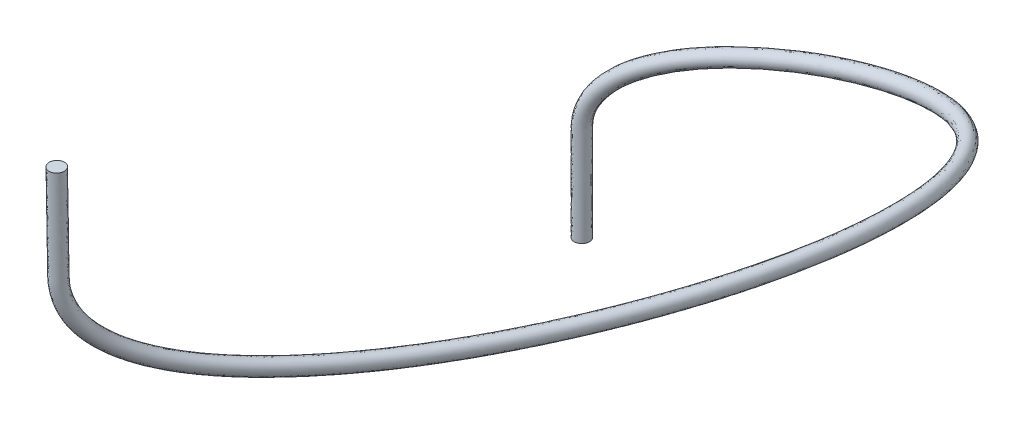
ISO-10303-21;
HEADER;
FILE_DESCRIPTION(('STEP AP214'),'2;1');
FILE_NAME('part.step','',(''),(''),'','','');
FILE_SCHEMA(('AUTOMOTIVE_DESIGN { 1 0 10303 214 1 1 1 1 }'));
ENDSEC;
DATA;
#1=APPLICATION_CONTEXT('core data for automotive mechanical design processes');
#2=APPLICATION_PROTOCOL_DEFINITION('international standard','automotive_design',2000,#1);
#3=PRODUCT_CONTEXT('',#1,'mechanical');
#4=PRODUCT('Part','Part','',(#3));
#5=PRODUCT_RELATED_PRODUCT_CATEGORY('part','',(#4));
#6=PRODUCT_DEFINITION_FORMATION('','',#4);
#7=PRODUCT_DEFINITION_CONTEXT('part definition',#1,'design');
#8=PRODUCT_DEFINITION('design','',#6,#7);
#9=PRODUCT_DEFINITION_SHAPE('','',#8);
#10=(LENGTH_UNIT() NAMED_UNIT(*) SI_UNIT(.MILLI.,.METRE.));
#11=(NAMED_UNIT(*) PLANE_ANGLE_UNIT() SI_UNIT($,.RADIAN.));
#12=(NAMED_UNIT(*) SI_UNIT($,.STERADIAN.) SOLID_ANGLE_UNIT());
#13=UNCERTAINTY_MEASURE_WITH_UNIT(LENGTH_MEASURE(1.E-05),#10,'distance_accuracy_value','');
#14=(GEOMETRIC_REPRESENTATION_CONTEXT(3) GLOBAL_UNCERTAINTY_ASSIGNED_CONTEXT((#13)) GLOBAL_UNIT_ASSIGNED_CONTEXT((#10,
#11,#12)) REPRESENTATION_CONTEXT('',''));
#15=CARTESIAN_POINT('',(0.,0.,0.));
#16=DIRECTION('',(0.,0.,1.));
#17=DIRECTION('',(1.,0.,0.));
#18=AXIS2_PLACEMENT_3D('',#15,#16,#17);
#19=CARTESIAN_POINT('',(50.7999999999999,71.5645,13.3985));
#20=DIRECTION('',(0.,1.,0.));
#21=DIRECTION('',(-1.,0.,0.));
#22=AXIS2_PLACEMENT_3D('',#19,#20,#21);
#23=PLANE('',#22);
#24=CARTESIAN_POINT('',(51.613000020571,71.5645,13.3985));
#25=CARTESIAN_POINT('',(51.613000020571,71.5645,12.9728141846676));
#26=CARTESIAN_POINT('',(51.2256858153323,71.5645,12.585499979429));
#27=CARTESIAN_POINT('',(50.3743141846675,71.5645,12.585499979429));
#28=CARTESIAN_POINT('',(49.9869999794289,71.5645,12.9728141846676));
#29=CARTESIAN_POINT('',(49.9869999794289,71.5645,13.8241858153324));
#30=CARTESIAN_POINT('',(50.3743141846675,71.5645,14.2115000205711));
#31=CARTESIAN_POINT('',(51.2256858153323,71.5645,14.2115000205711));
#32=CARTESIAN_POINT('',(51.613000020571,71.5645,13.8241858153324));
#33=CARTESIAN_POINT('',(51.613000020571,71.5645,13.3985));
#34=B_SPLINE_CURVE_WITH_KNOTS('',3,(#24,#25,#26,#27,#28,#29,#30,#31,#32,#33),.UNSPECIFIED.,.T.,
.F.,(4,2,2,2,4),(0.,0.25,0.5,0.75,1.),.UNSPECIFIED.);
#35=CARTESIAN_POINT('',(51.613000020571,71.5645,13.3985));
#36=VERTEX_POINT('',#35);
#37=EDGE_CURVE('E25',#36,#36,#34,.T.);
#38=ORIENTED_EDGE('',*,*,#37,.F.);
#39=EDGE_LOOP('',(#38));
#40=FACE_BOUND('',#39,.T.);
#41=ADVANCED_FACE('F15',(#40),#23,.F.);
#42=CARTESIAN_POINT('',(69.1868432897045,124.059388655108,87.1141724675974));
#43=DIRECTION('',(0.,0.999847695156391,0.0174524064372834));
#44=DIRECTION('',(0.997030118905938,-0.00134405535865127,0.0770008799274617));
#45=AXIS2_PLACEMENT_3D('',#42,#43,#44);
#46=PLANE('',#45);
#47=CARTESIAN_POINT('',(68.376257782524,124.060481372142,87.0515707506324));
#48=CARTESIAN_POINT('',(68.4090409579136,124.067888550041,86.6272138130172));
#49=CARTESIAN_POINT('',(68.8250329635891,124.074107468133,86.2709322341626));
#50=CARTESIAN_POINT('',(69.673876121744,124.07296317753,86.3364885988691));
#51=CARTESIAN_POINT('',(70.0302119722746,124.065703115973,86.7524172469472));
#52=CARTESIAN_POINT('',(69.9646456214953,124.050888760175,87.6011311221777));
#53=CARTESIAN_POINT('',(69.5486536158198,124.044669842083,87.9574127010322));
#54=CARTESIAN_POINT('',(68.6998104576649,124.045814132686,87.8918563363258));
#55=CARTESIAN_POINT('',(68.3434746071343,124.053074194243,87.4759276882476));
#56=CARTESIAN_POINT('',(68.376257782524,124.060481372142,87.0515707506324));
#57=B_SPLINE_CURVE_WITH_KNOTS('',3,(#47,#48,#49,#50,#51,#52,#53,#54,#55,#56),.UNSPECIFIED.,.T.,
.F.,(4,2,2,2,4),(0.,0.25,0.5,0.75,1.),.UNSPECIFIED.);
#58=CARTESIAN_POINT('',(68.376257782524,124.060481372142,87.0515707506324));
#59=VERTEX_POINT('',#58);
#60=EDGE_CURVE('E10',#59,#59,#57,.F.);
#61=ORIENTED_EDGE('',*,*,#60,.T.);
#62=EDGE_LOOP('',(#61));
#63=FACE_BOUND('',#62,.T.);
#64=ADVANCED_FACE('F33',(#63),#46,.T.);
#65=CARTESIAN_POINT('',(51.613000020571,71.5645,13.3985));
#66=CARTESIAN_POINT('',(51.6130000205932,74.7632466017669,13.3985000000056));
#67=CARTESIAN_POINT('',(51.6131398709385,78.9634218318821,13.4099341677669));
#68=CARTESIAN_POINT('',(51.6118456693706,82.9005774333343,13.4442220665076));
#69=CARTESIAN_POINT('',(52.029580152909,83.9173640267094,13.3042981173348));
#70=CARTESIAN_POINT('',(53.5431929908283,86.0515290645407,12.8288250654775));
#71=CARTESIAN_POINT('',(54.6488081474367,87.0616244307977,12.4902943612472));
#72=CARTESIAN_POINT('',(58.7017758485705,89.8802265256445,11.3593784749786));
#73=CARTESIAN_POINT('',(62.3208688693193,91.4703244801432,10.4698475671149));
#74=CARTESIAN_POINT('',(73.4478905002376,95.0920083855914,8.12497083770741));
#75=CARTESIAN_POINT('',(81.2426269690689,96.4136495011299,7.47482045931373));
#76=CARTESIAN_POINT('',(90.8979193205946,98.03423919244,11.5997255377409));
#77=CARTESIAN_POINT('',(92.4731165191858,98.2078756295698,16.8489973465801));
#78=CARTESIAN_POINT('',(91.8996524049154,98.4220433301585,30.543460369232));
#79=CARTESIAN_POINT('',(89.6071188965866,98.4605445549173,38.9733592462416));
#80=CARTESIAN_POINT('',(83.4004500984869,99.1605925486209,56.3878073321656));
#81=CARTESIAN_POINT('',(79.3563143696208,99.8175887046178,65.5343596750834));
#82=CARTESIAN_POINT('',(73.7289225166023,103.007696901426,76.7847322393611));
#83=CARTESIAN_POINT('',(71.9809860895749,104.379361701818,80.1394346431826));
#84=CARTESIAN_POINT('',(69.9734392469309,107.265662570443,83.9129531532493));
#85=CARTESIAN_POINT('',(69.4118644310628,108.36450238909,84.952636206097));
#86=CARTESIAN_POINT('',(68.6122048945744,110.921915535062,86.4320876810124));
#87=CARTESIAN_POINT('',(68.3748236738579,112.423328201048,86.8711083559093));
#88=CARTESIAN_POINT('',(68.3757362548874,116.904421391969,86.9322090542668));
#89=CARTESIAN_POINT('',(68.3762577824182,120.67969669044,86.9925589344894));
#90=CARTESIAN_POINT('',(68.376257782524,124.060481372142,87.0515707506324));
#91=CARTESIAN_POINT('',(51.613000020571,71.5645,12.9728141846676));
#92=CARTESIAN_POINT('',(51.613000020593,74.7335254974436,12.9728141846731));
#93=CARTESIAN_POINT('',(51.6191110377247,79.002994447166,12.9841219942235));
#94=CARTESIAN_POINT('',(51.6357937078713,82.8804249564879,13.0191677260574));
#95=CARTESIAN_POINT('',(52.0445546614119,83.8385707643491,12.8852770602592));
#96=CARTESIAN_POINT('',(53.5447920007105,85.919322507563,12.4232019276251));
#97=CARTESIAN_POINT('',(54.6466438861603,86.9099619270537,12.0917839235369));
#98=CARTESIAN_POINT('',(58.7062225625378,89.6613098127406,10.9910070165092));
#99=CARTESIAN_POINT('',(62.3449404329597,91.1952276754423,10.1458761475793));
#100=CARTESIAN_POINT('',(73.4646093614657,94.8147091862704,7.80238583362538));
#101=CARTESIAN_POINT('',(81.2777949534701,96.1470286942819,7.11305510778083));
#102=CARTESIAN_POINT('',(91.2177502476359,97.8045955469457,11.3674644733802));
#103=CARTESIAN_POINT('',(92.8330984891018,97.9750719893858,16.8041569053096));
#104=CARTESIAN_POINT('',(92.216780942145,98.1395563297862,30.6171204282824));
#105=CARTESIAN_POINT('',(89.8649675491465,98.1303414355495,39.0526254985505));
#106=CARTESIAN_POINT('',(83.6419586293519,98.8322550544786,56.5129923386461));
#107=CARTESIAN_POINT('',(79.6259502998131,99.5137718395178,65.6883199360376));
#108=CARTESIAN_POINT('',(73.8838887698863,102.661432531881,76.98264826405));
#109=CARTESIAN_POINT('',(72.1027729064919,104.030522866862,80.3641549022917));
#110=CARTESIAN_POINT('',(70.03351966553,106.971370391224,84.2169987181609));
#111=CARTESIAN_POINT('',(69.4486675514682,108.100584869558,85.2908266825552));
#112=CARTESIAN_POINT('',(68.6073253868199,110.763332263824,86.8323466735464));
#113=CARTESIAN_POINT('',(68.3539298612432,112.379312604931,87.2955883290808));
#114=CARTESIAN_POINT('',(68.3458157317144,116.9609708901,87.3579362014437));
#115=CARTESIAN_POINT('',(68.3434746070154,120.624251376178,87.4160773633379));
#116=CARTESIAN_POINT('',(68.3434746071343,124.053074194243,87.4759276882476));
#117=CARTESIAN_POINT('',(51.2256858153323,71.5645,12.585499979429));
#118=CARTESIAN_POINT('',(51.2256858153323,74.7718197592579,12.5854999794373));
#119=CARTESIAN_POINT('',(51.2371087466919,78.9520069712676,12.5912654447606));
#120=CARTESIAN_POINT('',(51.270846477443,82.9063904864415,12.6106359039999));
#121=CARTESIAN_POINT('',(51.7066231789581,83.9349418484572,12.4635284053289));
#122=CARTESIAN_POINT('',(53.261258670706,86.0553834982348,11.9732538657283));
#123=CARTESIAN_POINT('',(54.3897287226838,87.0471157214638,11.6267935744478));
#124=CARTESIAN_POINT('',(58.5237456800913,89.760597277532,10.4802225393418));
#125=CARTESIAN_POINT('',(62.2058710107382,91.2081847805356,9.61579812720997));
#126=CARTESIAN_POINT('',(73.385853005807,94.8476143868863,7.25961100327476));
#127=CARTESIAN_POINT('',(81.2459062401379,96.1983433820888,6.51250528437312));
#128=CARTESIAN_POINT('',(91.6788481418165,97.9205543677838,10.9735894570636));
#129=CARTESIAN_POINT('',(93.3735545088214,98.0886646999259,16.719601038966));
#130=CARTESIAN_POINT('',(92.7612027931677,98.1737037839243,30.7378867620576));
#131=CARTESIAN_POINT('',(90.3882489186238,98.0745746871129,39.2078288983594));
#132=CARTESIAN_POINT('',(84.1440600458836,98.7789180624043,56.727633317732));
#133=CARTESIAN_POINT('',(80.1356244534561,99.5168774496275,65.9092822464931));
#134=CARTESIAN_POINT('',(74.3471954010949,102.543682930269,77.2540352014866));
#135=CARTESIAN_POINT('',(72.547548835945,103.892770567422,80.6552004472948));
#136=CARTESIAN_POINT('',(70.4452606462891,106.841796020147,84.5547493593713));
#137=CARTESIAN_POINT('',(69.8480352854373,107.981298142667,85.6474872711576));
#138=CARTESIAN_POINT('',(68.9842044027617,110.687779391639,87.2237347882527));
#139=CARTESIAN_POINT('',(68.7217778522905,112.355410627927,87.7011023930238));
#140=CARTESIAN_POINT('',(68.704984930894,116.983147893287,87.7720013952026));
#141=CARTESIAN_POINT('',(68.699810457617,120.594913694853,87.831620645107));
#142=CARTESIAN_POINT('',(68.6998104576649,124.045814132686,87.8918563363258));
#143=CARTESIAN_POINT('',(50.3743141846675,71.5645,12.585499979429));
#144=CARTESIAN_POINT('',(50.3743141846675,74.915438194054,12.5854999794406));
#145=CARTESIAN_POINT('',(50.3854711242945,78.7607840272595,12.57933530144));
#146=CARTESIAN_POINT('',(50.4207445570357,83.0037713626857,12.562733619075));
#147=CARTESIAN_POINT('',(50.9338527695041,84.304365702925,12.3745070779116));
#148=CARTESIAN_POINT('',(52.6348141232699,86.6188779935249,11.7954503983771));
#149=CARTESIAN_POINT('',(53.8293212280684,87.6519242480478,11.4016996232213));
#150=CARTESIAN_POINT('',(58.1137421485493,90.4166786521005,10.09418863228));
#151=CARTESIAN_POINT('',(61.8520335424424,91.7868599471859,9.09855419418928));
#152=CARTESIAN_POINT('',(73.1792976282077,95.4745430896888,6.71168484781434));
#153=CARTESIAN_POINT('',(81.1054743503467,96.8443819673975,5.91594218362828));
#154=CARTESIAN_POINT('',(92.052744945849,98.6347356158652,10.5723183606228));
#155=CARTESIAN_POINT('',(93.8415896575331,98.8039648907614,16.6234161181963));
#156=CARTESIAN_POINT('',(93.323662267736,98.8137387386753,30.8560281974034));
#157=CARTESIAN_POINT('',(91.0227983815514,98.6123976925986,39.3904555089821));
#158=CARTESIAN_POINT('',(84.7647332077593,99.3183507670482,56.9490746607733));
#159=CARTESIAN_POINT('',(80.7166887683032,100.131337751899,66.087068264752));
#160=CARTESIAN_POINT('',(75.0556766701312,102.977381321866,77.4547501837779));
#161=CARTESIAN_POINT('',(73.2816558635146,104.287649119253,80.8455193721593));
#162=CARTESIAN_POINT('',(71.2301649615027,107.145557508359,84.6890821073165));
#163=CARTESIAN_POINT('',(70.6522960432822,108.246924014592,85.7550969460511));
#164=CARTESIAN_POINT('',(69.8223970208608,110.838869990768,87.2835434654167));
#165=CARTESIAN_POINT('',(69.5721476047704,112.390901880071,87.7435199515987));
#166=CARTESIAN_POINT('',(69.5543308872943,116.918797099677,87.8307212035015));
#167=CARTESIAN_POINT('',(69.5486536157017,120.641315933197,87.898006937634));
#168=CARTESIAN_POINT('',(69.5486536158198,124.044669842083,87.9574127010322));
#169=CARTESIAN_POINT('',(49.9869999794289,71.5645,12.9728141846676));
#170=CARTESIAN_POINT('',(49.9869999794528,75.0078165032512,12.9728141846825));
#171=CARTESIAN_POINT('',(49.9926029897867,78.6377855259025,12.9613370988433));
#172=CARTESIAN_POINT('',(50.0122186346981,83.0664087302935,12.9276811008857));
#173=CARTESIAN_POINT('',(50.5686718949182,84.5441183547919,12.7152588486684));
#174=CARTESIAN_POINT('',(52.348371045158,86.9955177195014,12.0836223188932));
#175=CARTESIAN_POINT('',(53.5763444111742,88.065061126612,11.6618861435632));
#176=CARTESIAN_POINT('',(57.9231734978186,90.9143329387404,10.2537365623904));
#177=CARTESIAN_POINT('',(61.6691606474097,92.3004158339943,9.15801300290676));
#178=CARTESIAN_POINT('',(73.0701176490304,96.0120548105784,6.75592396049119));
#179=CARTESIAN_POINT('',(81.0095898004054,97.3808715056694,5.97370351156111));
#180=CARTESIAN_POINT('',(91.9318405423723,99.1685812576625,10.6010931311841));
#181=CARTESIAN_POINT('',(93.726979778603,99.3411947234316,16.6204572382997));
#182=CARTESIAN_POINT('',(93.2909994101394,99.3619330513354,30.8427539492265));
#183=CARTESIAN_POINT('',(91.0768677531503,99.1575077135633,39.4014166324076));
#184=CARTESIAN_POINT('',(84.8273570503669,99.8624956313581,56.9359141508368));
#185=CARTESIAN_POINT('',(80.7357013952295,100.687304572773,66.0278662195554));
#186=CARTESIAN_POINT('',(75.2369883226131,103.489735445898,77.3659856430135));
#187=CARTESIAN_POINT('',(73.5048140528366,104.784685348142,80.7276372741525));
#188=CARTESIAN_POINT('',(71.5325764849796,107.551512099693,84.4735553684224));
#189=CARTESIAN_POINT('',(70.9846924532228,108.607892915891,85.4963460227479));
#190=CARTESIAN_POINT('',(70.208155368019,111.051894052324,86.9465728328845));
#191=CARTESIAN_POINT('',(69.9780164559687,112.447095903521,87.3765998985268));
#192=CARTESIAN_POINT('',(69.967947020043,116.838069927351,87.4700827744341));
#193=CARTESIAN_POINT('',(69.964645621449,120.712873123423,87.5428658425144));
#194=CARTESIAN_POINT('',(69.9646456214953,124.050888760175,87.6011311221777));
#195=CARTESIAN_POINT('',(49.9869999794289,71.5645,13.8241858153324));
#196=CARTESIAN_POINT('',(49.9869999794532,75.0672587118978,13.8241858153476));
#197=CARTESIAN_POINT('',(49.9806606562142,78.5586402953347,13.8129614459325));
#198=CARTESIAN_POINT('',(49.9643225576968,83.1067136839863,13.7777897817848));
#199=CARTESIAN_POINT('',(50.5387228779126,84.7017048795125,13.5533009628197));
#200=CARTESIAN_POINT('',(52.3451730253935,87.2599308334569,12.8948685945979));
#201=CARTESIAN_POINT('',(53.5806729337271,88.3683861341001,12.4589070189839));
#202=CARTESIAN_POINT('',(57.9142800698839,91.3521663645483,10.9904794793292));
#203=CARTESIAN_POINT('',(61.621017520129,92.8506094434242,9.80595584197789));
#204=CARTESIAN_POINT('',(73.0366799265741,96.5666532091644,7.40109396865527));
#205=CARTESIAN_POINT('',(80.9392538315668,97.9141131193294,6.6972342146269));
#206=CARTESIAN_POINT('',(91.2921786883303,99.6278685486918,11.0656152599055));
#207=CARTESIAN_POINT('',(93.0070158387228,99.8068020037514,16.7101381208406));
#208=CARTESIAN_POINT('',(92.6567423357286,99.9269070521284,30.6954338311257));
#209=CARTESIAN_POINT('',(90.5611704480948,99.8179139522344,39.2428841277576));
#210=CARTESIAN_POINT('',(84.3443399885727,100.519170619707,56.685544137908));
#211=CARTESIAN_POINT('',(80.1964295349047,101.294938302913,65.7199456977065));
#212=CARTESIAN_POINT('',(74.9270558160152,104.182264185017,76.9701535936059));
#213=CARTESIAN_POINT('',(73.2612404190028,105.482363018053,80.2781967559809));
#214=CARTESIAN_POINT('',(71.4124156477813,108.14009645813,83.8654642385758));
#215=CARTESIAN_POINT('',(70.9110862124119,109.135727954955,84.8199650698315));
#216=CARTESIAN_POINT('',(70.2179143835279,111.3690605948,86.1460548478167));
#217=CARTESIAN_POINT('',(70.0198040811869,112.535127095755,86.5276399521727));
#218=CARTESIAN_POINT('',(70.0277880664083,116.724970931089,86.6186284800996));
#219=CARTESIAN_POINT('',(70.0302119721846,120.823763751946,86.6958289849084));
#220=CARTESIAN_POINT('',(70.0302119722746,124.065703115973,86.7524172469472));
#221=CARTESIAN_POINT('',(50.3743141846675,71.5645,14.2115000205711));
#222=CARTESIAN_POINT('',(50.3743141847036,75.0289644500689,14.2115000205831));
#223=CARTESIAN_POINT('',(50.362662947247,78.6096277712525,14.2058179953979));
#224=CARTESIAN_POINT('',(50.3292697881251,83.0807481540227,14.186321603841));
#225=CARTESIAN_POINT('',(50.8766543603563,84.6053337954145,13.9750496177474));
#226=CARTESIAN_POINT('',(52.6287063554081,87.123869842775,13.3448166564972));
#227=CARTESIAN_POINT('',(53.8375880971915,88.23123233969,12.92389736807));
#228=CARTESIAN_POINT('',(58.0967569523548,91.2528788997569,11.5012639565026));
#229=CARTESIAN_POINT('',(61.7600869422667,92.8376523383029,10.3360338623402));
#230=CARTESIAN_POINT('',(73.1154362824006,96.5337480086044,7.94386879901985));
#231=CARTESIAN_POINT('',(80.9711425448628,97.8627984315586,7.29778403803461));
#232=CARTESIAN_POINT('',(90.8310807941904,99.5119097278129,11.4594902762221));
#233=CARTESIAN_POINT('',(92.4665598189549,99.6932092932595,16.7946939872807));
#234=CARTESIAN_POINT('',(92.1123204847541,99.8927595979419,30.574667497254));
#235=CARTESIAN_POINT('',(90.0378890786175,99.8736807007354,39.0876807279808));
#236=CARTESIAN_POINT('',(83.842238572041,100.572507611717,56.4709031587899));
#237=CARTESIAN_POINT('',(79.6867553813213,101.291832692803,65.4989833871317));
#238=CARTESIAN_POINT('',(74.4637491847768,104.300013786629,76.698766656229));
#239=CARTESIAN_POINT('',(72.8164644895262,105.620115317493,79.9871512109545));
#240=CARTESIAN_POINT('',(71.0006746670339,108.269670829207,83.5277135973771));
#241=CARTESIAN_POINT('',(70.5117184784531,109.255014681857,84.4633044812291));
#242=CARTESIAN_POINT('',(69.8410353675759,111.444613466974,85.7546667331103));
#243=CARTESIAN_POINT('',(69.6519560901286,112.559029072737,86.1221258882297));
#244=CARTESIAN_POINT('',(69.6686188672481,116.702793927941,86.2045632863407));
#245=CARTESIAN_POINT('',(69.6738761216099,120.853101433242,86.2802857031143));
#246=CARTESIAN_POINT('',(69.673876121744,124.07296317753,86.3364885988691));
#247=CARTESIAN_POINT('',(51.2256858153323,71.5645,14.2115000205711));
#248=CARTESIAN_POINT('',(51.2256858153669,74.8853460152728,14.2115000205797));
#249=CARTESIAN_POINT('',(51.2143005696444,78.8008507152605,14.217748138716));
#250=CARTESIAN_POINT('',(51.1793717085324,82.9833672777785,14.2342238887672));
#251=CARTESIAN_POINT('',(51.6494247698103,84.2359099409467,14.0640709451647));
#252=CARTESIAN_POINT('',(53.2551509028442,86.5603753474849,13.5226201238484));
#253=CARTESIAN_POINT('',(54.3979955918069,87.6264238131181,13.1489913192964));
#254=CARTESIAN_POINT('',(58.5067604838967,90.5967975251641,11.8872978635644));
#255=CARTESIAN_POINT('',(62.1139244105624,92.2589771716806,10.8532777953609));
#256=CARTESIAN_POINT('',(73.3219916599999,95.906819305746,8.49179495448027));
#257=CARTESIAN_POINT('',(81.111574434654,97.2167598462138,7.89434713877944));
#258=CARTESIAN_POINT('',(90.4571839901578,98.7977284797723,11.8607613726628));
#259=CARTESIAN_POINT('',(91.9985246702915,98.9779091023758,16.8908789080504));
#260=CARTESIAN_POINT('',(91.5498610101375,99.2527246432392,30.4565260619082));
#261=CARTESIAN_POINT('',(89.4033396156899,99.3358576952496,38.9050541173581));
#262=CARTESIAN_POINT('',(83.2215654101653,100.033074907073,56.2494618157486));
#263=CARTESIAN_POINT('',(79.1056910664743,100.677372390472,65.3211973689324));
#264=CARTESIAN_POINT('',(73.7552679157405,103.866315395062,76.4980516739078));
#265=CARTESIAN_POINT('',(72.0823574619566,105.225236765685,79.79683228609));
#266=CARTESIAN_POINT('',(70.2157703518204,107.965909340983,83.3933808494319));
#267=CARTESIAN_POINT('',(69.7074577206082,108.989388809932,84.3556948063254));
#268=CARTESIAN_POINT('',(69.0028427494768,111.293522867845,85.6948580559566));
#269=CARTESIAN_POINT('',(68.8015863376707,112.523537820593,86.0797083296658));
#270=CARTESIAN_POINT('',(68.819272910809,116.767144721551,86.1458434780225));
#271=CARTESIAN_POINT('',(68.8250329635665,120.806699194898,86.2138994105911));
#272=CARTESIAN_POINT('',(68.8250329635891,124.074107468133,86.2709322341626));
#273=CARTESIAN_POINT('',(51.613000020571,71.5645,13.8241858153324));
#274=CARTESIAN_POINT('',(51.6130000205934,74.7929677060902,13.824185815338));
#275=CARTESIAN_POINT('',(51.6071687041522,78.9238492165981,13.8357463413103));
#276=CARTESIAN_POINT('',(51.58789763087,82.9207299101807,13.8692764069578));
#277=CARTESIAN_POINT('',(52.0146056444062,83.9961572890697,13.7233191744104));
#278=CARTESIAN_POINT('',(53.541593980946,86.1837356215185,13.2344482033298));
#279=CARTESIAN_POINT('',(54.6509724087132,87.2132869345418,12.8888047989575));
#280=CARTESIAN_POINT('',(58.6973291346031,90.0991432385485,11.7277499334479));
#281=CARTESIAN_POINT('',(62.296797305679,91.7454212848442,10.7938189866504));
#282=CARTESIAN_POINT('',(73.4311716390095,95.3693075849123,8.44755584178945));
#283=CARTESIAN_POINT('',(81.2074589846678,96.680270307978,7.83658581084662));
#284=CARTESIAN_POINT('',(90.5780883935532,98.2638828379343,11.8319866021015));
#285=CARTESIAN_POINT('',(92.1131345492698,98.4406792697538,16.8938377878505));
#286=CARTESIAN_POINT('',(91.5825238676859,98.7045303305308,30.4698003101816));
#287=CARTESIAN_POINT('',(89.3492702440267,98.790747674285,38.8940929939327));
#288=CARTESIAN_POINT('',(83.158941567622,99.4889300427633,56.2626223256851));
#289=CARTESIAN_POINT('',(79.0866784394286,100.121405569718,65.3803994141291));
#290=CARTESIAN_POINT('',(73.5739562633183,103.35396127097,76.5868162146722));
#291=CARTESIAN_POINT('',(71.859199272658,104.728200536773,79.9147143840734));
#292=CARTESIAN_POINT('',(69.9133588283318,107.559954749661,83.6089075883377));
#293=CARTESIAN_POINT('',(69.3750613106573,108.628419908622,84.6144457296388));
#294=CARTESIAN_POINT('',(68.6170844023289,111.0804988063,86.0318286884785));
#295=CARTESIAN_POINT('',(68.3957174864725,112.467343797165,86.4466283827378));
#296=CARTESIAN_POINT('',(68.4056567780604,116.847871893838,86.5064819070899));
#297=CARTESIAN_POINT('',(68.4090409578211,120.735142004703,86.5690405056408));
#298=CARTESIAN_POINT('',(68.4090409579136,124.067888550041,86.6272138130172));
#299=CARTESIAN_POINT('',(51.613000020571,71.5645,13.3985));
#300=CARTESIAN_POINT('',(51.6130000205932,74.7632466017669,13.3985000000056));
#301=CARTESIAN_POINT('',(51.6131398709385,78.9634218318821,13.4099341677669));
#302=CARTESIAN_POINT('',(51.6118456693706,82.9005774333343,13.4442220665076));
#303=CARTESIAN_POINT('',(52.029580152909,83.9173640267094,13.3042981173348));
#304=CARTESIAN_POINT('',(53.5431929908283,86.0515290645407,12.8288250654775));
#305=CARTESIAN_POINT('',(54.6488081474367,87.0616244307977,12.4902943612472));
#306=CARTESIAN_POINT('',(58.7017758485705,89.8802265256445,11.3593784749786));
#307=CARTESIAN_POINT('',(62.3208688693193,91.4703244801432,10.4698475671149));
#308=CARTESIAN_POINT('',(73.4478905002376,95.0920083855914,8.12497083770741));
#309=CARTESIAN_POINT('',(81.2426269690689,96.4136495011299,7.47482045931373));
#310=CARTESIAN_POINT('',(90.8979193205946,98.03423919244,11.5997255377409));
#311=CARTESIAN_POINT('',(92.4731165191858,98.2078756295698,16.8489973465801));
#312=CARTESIAN_POINT('',(91.8996524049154,98.4220433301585,30.543460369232));
#313=CARTESIAN_POINT('',(89.6071188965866,98.4605445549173,38.9733592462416));
#314=CARTESIAN_POINT('',(83.4004500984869,99.1605925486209,56.3878073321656));
#315=CARTESIAN_POINT('',(79.3563143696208,99.8175887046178,65.5343596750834));
#316=CARTESIAN_POINT('',(73.7289225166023,103.007696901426,76.7847322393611));
#317=CARTESIAN_POINT('',(71.9809860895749,104.379361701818,80.1394346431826));
#318=CARTESIAN_POINT('',(69.9734392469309,107.265662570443,83.9129531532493));
#319=CARTESIAN_POINT('',(69.4118644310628,108.36450238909,84.952636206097));
#320=CARTESIAN_POINT('',(68.6122048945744,110.921915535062,86.4320876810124));
#321=CARTESIAN_POINT('',(68.3748236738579,112.423328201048,86.8711083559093));
#322=CARTESIAN_POINT('',(68.3757362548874,116.904421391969,86.9322090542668));
#323=CARTESIAN_POINT('',(68.3762577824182,120.67969669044,86.9925589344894));
#324=CARTESIAN_POINT('',(68.376257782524,124.060481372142,87.0515707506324));
#325=B_SPLINE_SURFACE_WITH_KNOTS('',3,3,((#65,#66,#67,#68,#69,#70,#71,#72,#73,#74,#75,#76,#77,
#78,#79,#80,#81,#82,#83,#84,#85,#86,#87,#88,#89,#90),(#91,#92,#93,#94,#95,#96,#97,#98,#99,#100,
#101,#102,#103,#104,#105,#106,#107,#108,#109,#110,#111,#112,#113,#114,#115,#116),(#117,#118,
#119,#120,#121,#122,#123,#124,#125,#126,#127,#128,#129,#130,#131,#132,#133,#134,#135,#136,#137,
#138,#139,#140,#141,#142),(#143,#144,#145,#146,#147,#148,#149,#150,#151,#152,#153,#154,#155,
#156,#157,#158,#159,#160,#161,#162,#163,#164,#165,#166,#167,#168),(#169,#170,#171,#172,#173,
#174,#175,#176,#177,#178,#179,#180,#181,#182,#183,#184,#185,#186,#187,#188,#189,#190,#191,#192,
#193,#194),(#195,#196,#197,#198,#199,#200,#201,#202,#203,#204,#205,#206,#207,#208,#209,#210,
#211,#212,#213,#214,#215,#216,#217,#218,#219,#220),(#221,#222,#223,#224,#225,#226,#227,#228,
#229,#230,#231,#232,#233,#234,#235,#236,#237,#238,#239,#240,#241,#242,#243,#244,#245,#246),
(#247,#248,#249,#250,#251,#252,#253,#254,#255,#256,#257,#258,#259,#260,#261,#262,#263,#264,#265,
#266,#267,#268,#269,#270,#271,#272),(#273,#274,#275,#276,#277,#278,#279,#280,#281,#282,#283,
#284,#285,#286,#287,#288,#289,#290,#291,#292,#293,#294,#295,#296,#297,#298),(#299,#300,#301,
#302,#303,#304,#305,#306,#307,#308,#309,#310,#311,#312,#313,#314,#315,#316,#317,#318,#319,#320,
#321,#322,#323,#324)),.UNSPECIFIED.,.T.,.F.,.F.,(4,2,2,2,4),(4,2,2,2,2,2,2,2,2,2,2,2,4),(0.,
0.25,0.5,0.75,1.),(0.,0.0656669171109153,0.0991079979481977,0.13254907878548,0.199431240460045,
0.333195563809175,0.483479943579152,0.63376432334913,0.784048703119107,0.859190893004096,
0.89676198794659,0.934333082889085,1.),.UNSPECIFIED.);
#326=ORIENTED_EDGE('',*,*,#60,.F.);
#327=EDGE_LOOP('',(#326));
#328=FACE_BOUND('',#327,.T.);
#329=ORIENTED_EDGE('',*,*,#37,.T.);
#330=EDGE_LOOP('',(#329));
#331=FACE_BOUND('',#330,.T.);
#332=ADVANCED_FACE('F50',(#328,#331),#325,.T.);
#333=CLOSED_SHELL('',(#41,#64,#332));
#334=MANIFOLD_SOLID_BREP('B1',#333);
#335=ADVANCED_BREP_SHAPE_REPRESENTATION('',(#18,#334),#14);
#336=SHAPE_DEFINITION_REPRESENTATION(#9,#335);
ENDSEC;
END-ISO-10303-21;
